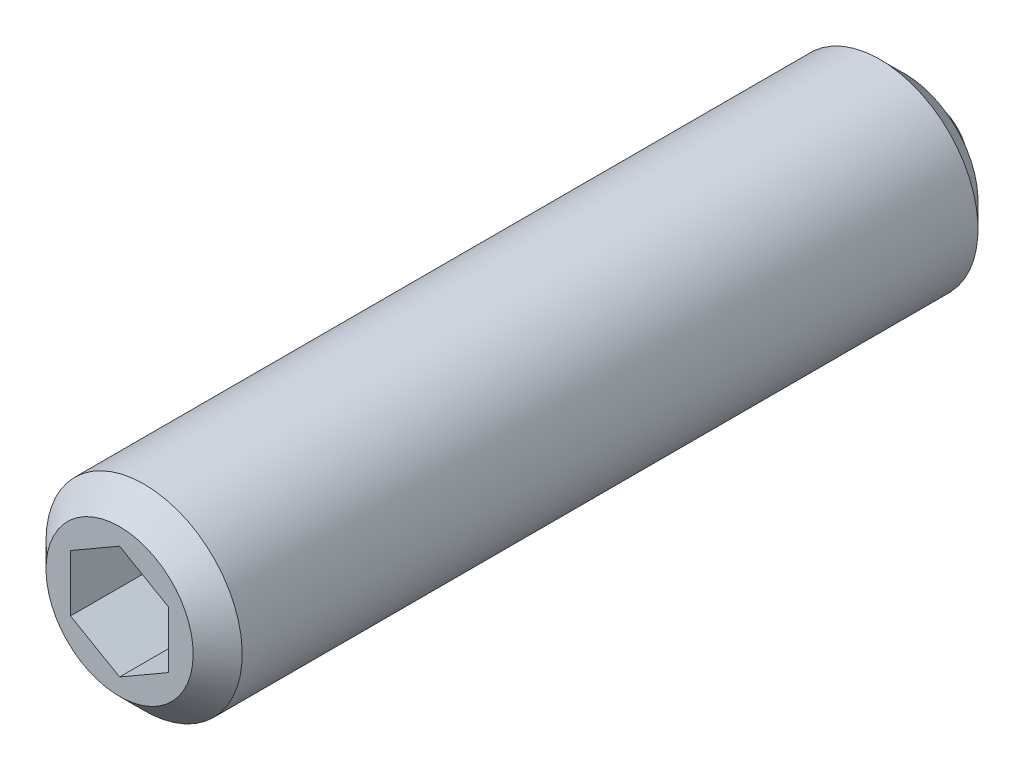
ISO-10303-21;
HEADER;
FILE_DESCRIPTION(('STEP AP214'),'2;1');
FILE_NAME('part.step','',(''),(''),'','','');
FILE_SCHEMA(('AUTOMOTIVE_DESIGN { 1 0 10303 214 1 1 1 1 }'));
ENDSEC;
DATA;
#1=APPLICATION_CONTEXT('core data for automotive mechanical design processes');
#2=APPLICATION_PROTOCOL_DEFINITION('international standard','automotive_design',2000,#1);
#3=PRODUCT_CONTEXT('',#1,'mechanical');
#4=PRODUCT('Part','Part','',(#3));
#5=PRODUCT_RELATED_PRODUCT_CATEGORY('part','',(#4));
#6=PRODUCT_DEFINITION_FORMATION('','',#4);
#7=PRODUCT_DEFINITION_CONTEXT('part definition',#1,'design');
#8=PRODUCT_DEFINITION('design','',#6,#7);
#9=PRODUCT_DEFINITION_SHAPE('','',#8);
#10=(LENGTH_UNIT() NAMED_UNIT(*) SI_UNIT(.MILLI.,.METRE.));
#11=(NAMED_UNIT(*) PLANE_ANGLE_UNIT() SI_UNIT($,.RADIAN.));
#12=(NAMED_UNIT(*) SI_UNIT($,.STERADIAN.) SOLID_ANGLE_UNIT());
#13=UNCERTAINTY_MEASURE_WITH_UNIT(LENGTH_MEASURE(1.E-05),#10,'distance_accuracy_value','');
#14=(GEOMETRIC_REPRESENTATION_CONTEXT(3) GLOBAL_UNCERTAINTY_ASSIGNED_CONTEXT((#13)) GLOBAL_UNIT_ASSIGNED_CONTEXT((#10,
#11,#12)) REPRESENTATION_CONTEXT('',''));
#15=CARTESIAN_POINT('',(0.,0.,0.));
#16=DIRECTION('',(0.,0.,1.));
#17=DIRECTION('',(1.,0.,0.));
#18=AXIS2_PLACEMENT_3D('',#15,#16,#17);
#19=CARTESIAN_POINT('',(-9.58979308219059E-09,0.,7.8));
#20=DIRECTION('',(0.,0.,1.));
#21=DIRECTION('',(0.,-1.,0.));
#22=AXIS2_PLACEMENT_3D('',#19,#20,#21);
#23=CYLINDRICAL_SURFACE('',#22,2.);
#24=CARTESIAN_POINT('',(-9.58979308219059E-09,0.,16.3));
#25=DIRECTION('',(0.,0.,-1.));
#26=DIRECTION('',(0.,1.,0.));
#27=AXIS2_PLACEMENT_3D('',#24,#25,#26);
#28=CIRCLE('',#27,2.);
#29=CARTESIAN_POINT('',(-9.58979308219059E-09,2.,16.2999999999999));
#30=VERTEX_POINT('',#29);
#31=EDGE_CURVE('E107',#30,#30,#28,.T.);
#32=ORIENTED_EDGE('',*,*,#31,.T.);
#33=EDGE_LOOP('',(#32));
#34=FACE_BOUND('',#33,.T.);
#35=CARTESIAN_POINT('',(0.,0.,1.3));
#36=DIRECTION('',(0.,0.,-1.));
#37=DIRECTION('',(-1.,0.,0.));
#38=AXIS2_PLACEMENT_3D('',#35,#36,#37);
#39=CIRCLE('',#38,2.0000000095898);
#40=CARTESIAN_POINT('',(-2.0000000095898,0.,1.3));
#41=VERTEX_POINT('',#40);
#42=EDGE_CURVE('E111',#41,#41,#39,.T.);
#43=ORIENTED_EDGE('',*,*,#42,.F.);
#44=EDGE_LOOP('',(#43));
#45=FACE_BOUND('',#44,.T.);
#46=ADVANCED_FACE('F14',(#34,#45),#23,.T.);
#47=CARTESIAN_POINT('',(-1.00000000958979,0.577350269,16.8));
#48=DIRECTION('',(-0.499999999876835,0.866025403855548,0.));
#49=DIRECTION('',(0.866025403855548,0.499999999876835,0.));
#50=AXIS2_PLACEMENT_3D('',#47,#48,#49);
#51=PLANE('',#50);
#52=DIRECTION('',(0.,0.,-1.));
#53=VECTOR('',#52,1.);
#54=CARTESIAN_POINT('',(-1.00000000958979,0.577350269,15.8));
#55=LINE('',#54,#53);
#56=CARTESIAN_POINT('',(-1.00000000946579,0.577350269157,16.8));
#57=VERTEX_POINT('',#56);
#58=CARTESIAN_POINT('',(-1.00000000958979,0.577350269,14.8));
#59=VERTEX_POINT('',#58);
#60=EDGE_CURVE('E87',#57,#59,#55,.T.);
#61=ORIENTED_EDGE('',*,*,#60,.T.);
#62=DIRECTION('',(-0.866025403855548,-0.499999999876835,0.));
#63=VECTOR('',#62,1.);
#64=CARTESIAN_POINT('',(-0.500000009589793,0.8660254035,14.8));
#65=LINE('',#64,#63);
#66=CARTESIAN_POINT('',(-9.58979308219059E-09,1.154700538,14.8));
#67=VERTEX_POINT('',#66);
#68=EDGE_CURVE('E22',#67,#59,#65,.T.);
#69=ORIENTED_EDGE('',*,*,#68,.F.);
#70=DIRECTION('',(0.,0.,1.));
#71=VECTOR('',#70,1.);
#72=CARTESIAN_POINT('',(-9.58979308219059E-09,1.154700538,15.8));
#73=LINE('',#72,#71);
#74=CARTESIAN_POINT('',(-9.21029304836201E-09,1.1547005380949,16.8));
#75=VERTEX_POINT('',#74);
#76=EDGE_CURVE('E121',#67,#75,#73,.T.);
#77=ORIENTED_EDGE('',*,*,#76,.T.);
#78=DIRECTION('',(0.866025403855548,0.499999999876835,0.));
#79=VECTOR('',#78,1.);
#80=CARTESIAN_POINT('',(-0.500000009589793,0.8660254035,16.8));
#81=LINE('',#80,#79);
#82=EDGE_CURVE('E30',#57,#75,#81,.T.);
#83=ORIENTED_EDGE('',*,*,#82,.F.);
#84=EDGE_LOOP('',(#61,#69,#77,#83));
#85=FACE_BOUND('',#84,.T.);
#86=ADVANCED_FACE('F145',(#85),#51,.F.);
#87=CARTESIAN_POINT('',(-1.00000000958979,-0.577350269,16.8));
#88=DIRECTION('',(-1.,0.,0.));
#89=DIRECTION('',(0.,1.,0.));
#90=AXIS2_PLACEMENT_3D('',#87,#88,#89);
#91=PLANE('',#90);
#92=DIRECTION('',(0.,0.,-1.));
#93=VECTOR('',#92,1.);
#94=CARTESIAN_POINT('',(-1.00000000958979,-0.577350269,15.8));
#95=LINE('',#94,#93);
#96=CARTESIAN_POINT('',(-1.00000000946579,-0.577350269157,16.8));
#97=VERTEX_POINT('',#96);
#98=CARTESIAN_POINT('',(-1.00000000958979,-0.577350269,14.8));
#99=VERTEX_POINT('',#98);
#100=EDGE_CURVE('E90',#97,#99,#95,.T.);
#101=ORIENTED_EDGE('',*,*,#100,.T.);
#102=DIRECTION('',(0.,-1.,0.));
#103=VECTOR('',#102,1.);
#104=CARTESIAN_POINT('',(-1.00000000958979,0.,14.8));
#105=LINE('',#104,#103);
#106=EDGE_CURVE('E79',#59,#99,#105,.T.);
#107=ORIENTED_EDGE('',*,*,#106,.F.);
#108=ORIENTED_EDGE('',*,*,#60,.F.);
#109=DIRECTION('',(0.,1.,0.));
#110=VECTOR('',#109,1.);
#111=CARTESIAN_POINT('',(-1.00000000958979,0.,16.8));
#112=LINE('',#111,#110);
#113=EDGE_CURVE('E88',#97,#57,#112,.T.);
#114=ORIENTED_EDGE('',*,*,#113,.F.);
#115=EDGE_LOOP('',(#101,#107,#108,#114));
#116=FACE_BOUND('',#115,.T.);
#117=ADVANCED_FACE('F91',(#116),#91,.F.);
#118=CARTESIAN_POINT('',(-9.58979308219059E-09,1.154700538,16.8));
#119=DIRECTION('',(0.499999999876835,0.866025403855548,0.));
#120=DIRECTION('',(0.866025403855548,-0.499999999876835,0.));
#121=AXIS2_PLACEMENT_3D('',#118,#119,#120);
#122=PLANE('',#121);
#123=ORIENTED_EDGE('',*,*,#76,.F.);
#124=DIRECTION('',(0.866025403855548,-0.499999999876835,0.));
#125=VECTOR('',#124,1.);
#126=CARTESIAN_POINT('',(-9.58979308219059E-09,1.154700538,14.8));
#127=LINE('',#126,#125);
#128=CARTESIAN_POINT('',(0.999999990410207,0.577350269,14.8));
#129=VERTEX_POINT('',#128);
#130=EDGE_CURVE('E94',#67,#129,#127,.T.);
#131=ORIENTED_EDGE('',*,*,#130,.T.);
#132=DIRECTION('',(0.,0.,1.));
#133=VECTOR('',#132,1.);
#134=CARTESIAN_POINT('',(0.999999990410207,0.577350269,15.8));
#135=LINE('',#134,#133);
#136=CARTESIAN_POINT('',(0.999999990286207,0.577350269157,16.8));
#137=VERTEX_POINT('',#136);
#138=EDGE_CURVE('E99',#129,#137,#135,.T.);
#139=ORIENTED_EDGE('',*,*,#138,.T.);
#140=DIRECTION('',(0.866025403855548,-0.499999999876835,0.));
#141=VECTOR('',#140,1.);
#142=CARTESIAN_POINT('',(0.499999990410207,0.8660254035,16.8));
#143=LINE('',#142,#141);
#144=EDGE_CURVE('E48',#75,#137,#143,.T.);
#145=ORIENTED_EDGE('',*,*,#144,.F.);
#146=EDGE_LOOP('',(#123,#131,#139,#145));
#147=FACE_BOUND('',#146,.T.);
#148=ADVANCED_FACE('F157',(#147),#122,.F.);
#149=CARTESIAN_POINT('',(-9.58979308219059E-09,-1.154700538,16.8));
#150=DIRECTION('',(-0.499999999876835,-0.866025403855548,0.));
#151=DIRECTION('',(-0.866025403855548,0.499999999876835,0.));
#152=AXIS2_PLACEMENT_3D('',#149,#150,#151);
#153=PLANE('',#152);
#154=DIRECTION('',(0.,0.,-1.));
#155=VECTOR('',#154,1.);
#156=CARTESIAN_POINT('',(-9.58979308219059E-09,-1.154700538,15.8));
#157=LINE('',#156,#155);
#158=CARTESIAN_POINT('',(-9.58979300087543E-09,-1.154700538,16.8));
#159=VERTEX_POINT('',#158);
#160=CARTESIAN_POINT('',(-9.58979308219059E-09,-1.154700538,14.8));
#161=VERTEX_POINT('',#160);
#162=EDGE_CURVE('E59',#159,#161,#157,.T.);
#163=ORIENTED_EDGE('',*,*,#162,.T.);
#164=DIRECTION('',(-0.866025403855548,0.499999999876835,0.));
#165=VECTOR('',#164,1.);
#166=CARTESIAN_POINT('',(-9.58979308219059E-09,-1.154700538,14.8));
#167=LINE('',#166,#165);
#168=EDGE_CURVE('E82',#161,#99,#167,.T.);
#169=ORIENTED_EDGE('',*,*,#168,.T.);
#170=ORIENTED_EDGE('',*,*,#100,.F.);
#171=DIRECTION('',(-0.866025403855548,0.499999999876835,0.));
#172=VECTOR('',#171,1.);
#173=CARTESIAN_POINT('',(-0.500000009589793,-0.8660254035,16.8));
#174=LINE('',#173,#172);
#175=EDGE_CURVE('E70',#159,#97,#174,.T.);
#176=ORIENTED_EDGE('',*,*,#175,.F.);
#177=EDGE_LOOP('',(#163,#169,#170,#176));
#178=FACE_BOUND('',#177,.T.);
#179=ADVANCED_FACE('F93',(#178),#153,.F.);
#180=CARTESIAN_POINT('',(-1.00000000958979,-1.154700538,14.8));
#181=DIRECTION('',(0.,0.,-1.));
#182=DIRECTION('',(0.,1.,0.));
#183=AXIS2_PLACEMENT_3D('',#180,#181,#182);
#184=PLANE('',#183);
#185=DIRECTION('',(0.866025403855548,0.499999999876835,0.));
#186=VECTOR('',#185,1.);
#187=CARTESIAN_POINT('',(0.499999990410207,-0.8660254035,14.8));
#188=LINE('',#187,#186);
#189=CARTESIAN_POINT('',(0.999999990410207,-0.577350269,14.8));
#190=VERTEX_POINT('',#189);
#191=EDGE_CURVE('E114',#161,#190,#188,.T.);
#192=ORIENTED_EDGE('',*,*,#191,.T.);
#193=DIRECTION('',(0.,1.,0.));
#194=VECTOR('',#193,1.);
#195=CARTESIAN_POINT('',(0.999999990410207,0.,14.8));
#196=LINE('',#195,#194);
#197=EDGE_CURVE('E95',#190,#129,#196,.T.);
#198=ORIENTED_EDGE('',*,*,#197,.T.);
#199=ORIENTED_EDGE('',*,*,#130,.F.);
#200=ORIENTED_EDGE('',*,*,#68,.T.);
#201=ORIENTED_EDGE('',*,*,#106,.T.);
#202=ORIENTED_EDGE('',*,*,#168,.F.);
#203=EDGE_LOOP('',(#192,#198,#199,#200,#201,#202));
#204=FACE_BOUND('',#203,.T.);
#205=ADVANCED_FACE('F81',(#204),#184,.F.);
#206=CARTESIAN_POINT('',(0.999999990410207,0.577350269,16.8));
#207=DIRECTION('',(1.,0.,0.));
#208=DIRECTION('',(0.,-1.,0.));
#209=AXIS2_PLACEMENT_3D('',#206,#207,#208);
#210=PLANE('',#209);
#211=ORIENTED_EDGE('',*,*,#138,.F.);
#212=ORIENTED_EDGE('',*,*,#197,.F.);
#213=DIRECTION('',(0.,0.,1.));
#214=VECTOR('',#213,1.);
#215=CARTESIAN_POINT('',(0.999999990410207,-0.577350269,15.8));
#216=LINE('',#215,#214);
#217=CARTESIAN_POINT('',(0.999999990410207,-0.577350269,16.8));
#218=VERTEX_POINT('',#217);
#219=EDGE_CURVE('E106',#190,#218,#216,.T.);
#220=ORIENTED_EDGE('',*,*,#219,.T.);
#221=DIRECTION('',(0.,-1.,0.));
#222=VECTOR('',#221,1.);
#223=CARTESIAN_POINT('',(0.999999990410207,0.,16.8));
#224=LINE('',#223,#222);
#225=EDGE_CURVE('E115',#137,#218,#224,.T.);
#226=ORIENTED_EDGE('',*,*,#225,.F.);
#227=EDGE_LOOP('',(#211,#212,#220,#226));
#228=FACE_BOUND('',#227,.T.);
#229=ADVANCED_FACE('F167',(#228),#210,.F.);
#230=CARTESIAN_POINT('',(0.999999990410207,-0.577350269,16.8));
#231=DIRECTION('',(0.499999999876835,-0.866025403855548,0.));
#232=DIRECTION('',(-0.866025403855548,-0.499999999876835,0.));
#233=AXIS2_PLACEMENT_3D('',#230,#231,#232);
#234=PLANE('',#233);
#235=ORIENTED_EDGE('',*,*,#219,.F.);
#236=ORIENTED_EDGE('',*,*,#191,.F.);
#237=ORIENTED_EDGE('',*,*,#162,.F.);
#238=DIRECTION('',(-0.866025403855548,-0.499999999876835,0.));
#239=VECTOR('',#238,1.);
#240=CARTESIAN_POINT('',(0.999999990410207,-0.577350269,16.8));
#241=LINE('',#240,#239);
#242=EDGE_CURVE('E103',#159,#218,#241,.F.);
#243=ORIENTED_EDGE('',*,*,#242,.T.);
#244=EDGE_LOOP('',(#235,#236,#237,#243));
#245=FACE_BOUND('',#244,.T.);
#246=ADVANCED_FACE('F146',(#245),#234,.F.);
#247=CARTESIAN_POINT('',(-1.51800000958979,-1.518,16.8));
#248=DIRECTION('',(0.,0.,-1.));
#249=DIRECTION('',(0.,1.,0.));
#250=AXIS2_PLACEMENT_3D('',#247,#248,#249);
#251=PLANE('',#250);
#252=ORIENTED_EDGE('',*,*,#175,.T.);
#253=ORIENTED_EDGE('',*,*,#113,.T.);
#254=ORIENTED_EDGE('',*,*,#82,.T.);
#255=ORIENTED_EDGE('',*,*,#144,.T.);
#256=ORIENTED_EDGE('',*,*,#225,.T.);
#257=ORIENTED_EDGE('',*,*,#242,.F.);
#258=EDGE_LOOP('',(#252,#253,#254,#255,#256,#257));
#259=FACE_BOUND('',#258,.T.);
#260=CARTESIAN_POINT('',(-9.58979308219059E-09,0.,16.8));
#261=DIRECTION('',(0.,0.,-1.));
#262=DIRECTION('',(0.,1.,0.));
#263=AXIS2_PLACEMENT_3D('',#260,#261,#262);
#264=CIRCLE('',#263,1.5);
#265=CARTESIAN_POINT('',(-9.58979308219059E-09,1.5,16.8));
#266=VERTEX_POINT('',#265);
#267=EDGE_CURVE('E108',#266,#266,#264,.F.);
#268=ORIENTED_EDGE('',*,*,#267,.T.);
#269=EDGE_LOOP('',(#268));
#270=FACE_BOUND('',#269,.T.);
#271=ADVANCED_FACE('F135',(#259,#270),#251,.F.);
#272=CARTESIAN_POINT('',(-9.58979308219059E-09,0.,16.8));
#273=DIRECTION('',(0.,0.,-1.));
#274=DIRECTION('',(0.,1.,0.));
#275=AXIS2_PLACEMENT_3D('',#272,#273,#274);
#276=CONICAL_SURFACE('',#275,1.5,0.785398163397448);
#277=ORIENTED_EDGE('',*,*,#267,.F.);
#278=EDGE_LOOP('',(#277));
#279=FACE_BOUND('',#278,.T.);
#280=ORIENTED_EDGE('',*,*,#31,.F.);
#281=EDGE_LOOP('',(#280));
#282=FACE_BOUND('',#281,.T.);
#283=ADVANCED_FACE('F132',(#279,#282),#276,.T.);
#284=CARTESIAN_POINT('',(0.,0.,0.8));
#285=DIRECTION('',(0.,0.,1.));
#286=DIRECTION('',(1.,0.,0.));
#287=AXIS2_PLACEMENT_3D('',#284,#285,#286);
#288=CONICAL_SURFACE('',#287,1.50000000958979,0.785398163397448);
#289=ORIENTED_EDGE('',*,*,#42,.T.);
#290=EDGE_LOOP('',(#289));
#291=FACE_BOUND('',#290,.T.);
#292=CARTESIAN_POINT('',(0.,0.,0.8));
#293=DIRECTION('',(0.,0.,-1.));
#294=DIRECTION('',(-1.,0.,0.));
#295=AXIS2_PLACEMENT_3D('',#292,#293,#294);
#296=CIRCLE('',#295,1.50000000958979);
#297=CARTESIAN_POINT('',(-1.50000000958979,0.,0.8));
#298=VERTEX_POINT('',#297);
#299=EDGE_CURVE('E186',#298,#298,#296,.T.);
#300=ORIENTED_EDGE('',*,*,#299,.F.);
#301=EDGE_LOOP('',(#300));
#302=FACE_BOUND('',#301,.T.);
#303=ADVANCED_FACE('F134',(#291,#302),#288,.T.);
#304=CARTESIAN_POINT('',(-1.51800000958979,-1.518,0.8));
#305=DIRECTION('',(0.,0.,-1.));
#306=DIRECTION('',(0.,1.,0.));
#307=AXIS2_PLACEMENT_3D('',#304,#305,#306);
#308=PLANE('',#307);
#309=CARTESIAN_POINT('',(0.,0.,0.8));
#310=DIRECTION('',(0.,0.,-1.));
#311=DIRECTION('',(-1.,0.,0.));
#312=AXIS2_PLACEMENT_3D('',#309,#310,#311);
#313=CIRCLE('',#312,1.16619037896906);
#314=CARTESIAN_POINT('',(-1.16619037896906,0.,0.8));
#315=VERTEX_POINT('',#314);
#316=EDGE_CURVE('E9',#315,#315,#313,.T.);
#317=ORIENTED_EDGE('',*,*,#316,.F.);
#318=EDGE_LOOP('',(#317));
#319=FACE_BOUND('',#318,.T.);
#320=ORIENTED_EDGE('',*,*,#299,.T.);
#321=EDGE_LOOP('',(#320));
#322=FACE_BOUND('',#321,.T.);
#323=ADVANCED_FACE('F142',(#319,#322),#308,.T.);
#324=CARTESIAN_POINT('',(0.,0.,1.25));
#325=DIRECTION('',(0.,0.,-1.));
#326=DIRECTION('',(1.,0.,0.));
#327=AXIS2_PLACEMENT_3D('',#324,#325,#326);
#328=SPHERICAL_SURFACE('',#327,1.25);
#329=CARTESIAN_POINT('',(-9.58979308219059E-09,0.,0.));
#330=VERTEX_POINT('',#329);
#331=VERTEX_LOOP('',#330);
#332=FACE_BOUND('',#331,.T.);
#333=ORIENTED_EDGE('',*,*,#316,.T.);
#334=EDGE_LOOP('',(#333));
#335=FACE_BOUND('',#334,.T.);
#336=ADVANCED_FACE('F175',(#332,#335),#328,.T.);
#337=CLOSED_SHELL('',(#46,#86,#117,#148,#179,#205,#229,#246,#271,#283,#303,#323,#336));
#338=MANIFOLD_SOLID_BREP('B1',#337);
#339=ADVANCED_BREP_SHAPE_REPRESENTATION('',(#18,#338),#14);
#340=SHAPE_DEFINITION_REPRESENTATION(#9,#339);
ENDSEC;
END-ISO-10303-21;
